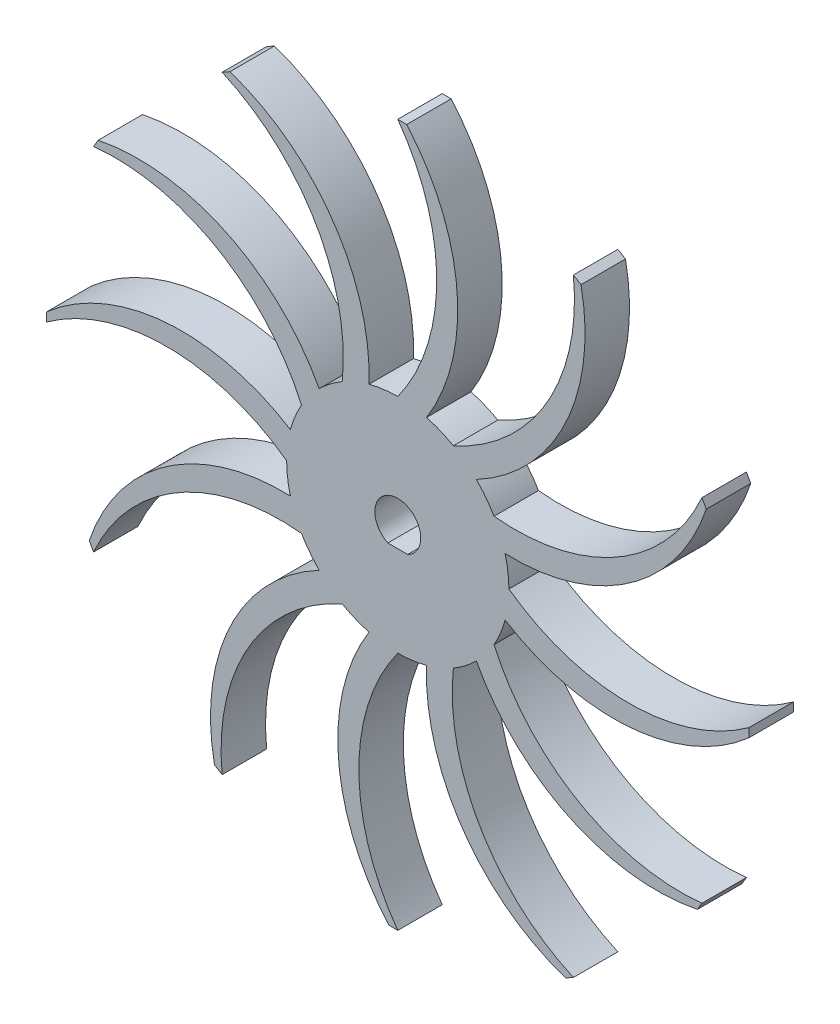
from build123d import *

# Parameters (mm, degrees)
BOSS_EXTRUDE1_DEPTH = 5
SKETCH3_R           = 12.5
BOSS_EXTRUDE2_DEPTH = 5
CIRPATTERN1_COUNT   = 12
CUT_EXTRUDE1_DEPTH  = 5
CUT_EXTRUDE2_DEPTH  = 5


with BuildPart() as part:
    # Sketch2 → Boss-Extrude1 (new body)
    with BuildSketch(Plane.XY):
        with BuildLine():
            Line((1, 39.487339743), (0, 39.5))
            ThreePointArc((0, 39.5), (4.37877555, 26), (0, 12.5))
            ThreePointArc((0, 12.5), (1.631577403, 12.393060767), (3.235238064, 12.074072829))
            ThreePointArc((3.235238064, 12.074072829), (6.666710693, 26.151632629), (1, 39.487339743))
        make_face()
    boss_extrude1 = extrude(amount=BOSS_EXTRUDE1_DEPTH)

    # Sketch3 → Boss-Extrude2 (add)
    with BuildSketch(Plane.XY):
        Circle(SKETCH3_R)
    extrude(amount=BOSS_EXTRUDE2_DEPTH)

    # CirPattern1: Boss-Extrude1 ×12 about axis
    cirpattern1_axis = Axis((0, 0, 0), (0, 0, 1))
    for i in range(1, CIRPATTERN1_COUNT):
        add(boss_extrude1.rotate(cirpattern1_axis, i * 360 / CIRPATTERN1_COUNT))

    # Sketch5 → Cut-Extrude1 (cut)
    with BuildSketch(Plane.XY.offset(5)):
        with BuildLine():
            Line((-1.101147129, -2.25), (1.101147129, -2.25))
            ThreePointArc((1.101147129, -2.25), (0, 2.505), (-1.101147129, -2.25))
        make_face()
    extrude(amount=-CUT_EXTRUDE1_DEPTH, mode=Mode.SUBTRACT)

    # Sketch6 → Cut-Extrude2 (cut)
    with BuildSketch(Plane.XY.offset(5)):
        with BuildLine():
            Line((-1.118380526, -2.325), (1.118380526, -2.325))
            ThreePointArc((1.118380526, -2.325), (0, 2.58), (-1.118380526, -2.325))
        make_face()
    extrude(amount=-CUT_EXTRUDE2_DEPTH, mode=Mode.SUBTRACT)


solid = part.part
